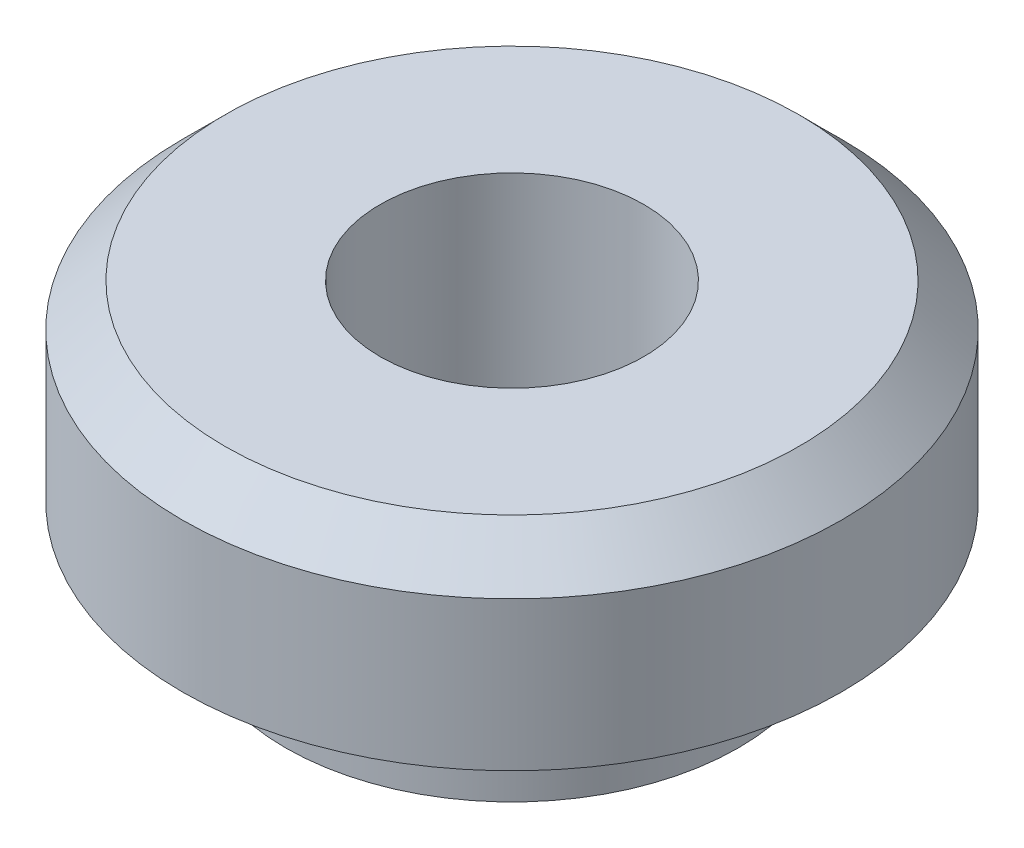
ISO-10303-21;
HEADER;
FILE_DESCRIPTION(('STEP AP214'),'2;1');
FILE_NAME('part.step','',(''),(''),'','','');
FILE_SCHEMA(('AUTOMOTIVE_DESIGN { 1 0 10303 214 1 1 1 1 }'));
ENDSEC;
DATA;
#1=APPLICATION_CONTEXT('core data for automotive mechanical design processes');
#2=APPLICATION_PROTOCOL_DEFINITION('international standard','automotive_design',2000,#1);
#3=PRODUCT_CONTEXT('',#1,'mechanical');
#4=PRODUCT('Part','Part','',(#3));
#5=PRODUCT_RELATED_PRODUCT_CATEGORY('part','',(#4));
#6=PRODUCT_DEFINITION_FORMATION('','',#4);
#7=PRODUCT_DEFINITION_CONTEXT('part definition',#1,'design');
#8=PRODUCT_DEFINITION('design','',#6,#7);
#9=PRODUCT_DEFINITION_SHAPE('','',#8);
#10=(LENGTH_UNIT() NAMED_UNIT(*) SI_UNIT(.MILLI.,.METRE.));
#11=(NAMED_UNIT(*) PLANE_ANGLE_UNIT() SI_UNIT($,.RADIAN.));
#12=(NAMED_UNIT(*) SI_UNIT($,.STERADIAN.) SOLID_ANGLE_UNIT());
#13=UNCERTAINTY_MEASURE_WITH_UNIT(LENGTH_MEASURE(1.E-05),#10,'distance_accuracy_value','');
#14=(GEOMETRIC_REPRESENTATION_CONTEXT(3) GLOBAL_UNCERTAINTY_ASSIGNED_CONTEXT((#13)) GLOBAL_UNIT_ASSIGNED_CONTEXT((#10,
#11,#12)) REPRESENTATION_CONTEXT('',''));
#15=CARTESIAN_POINT('',(0.,0.,0.));
#16=DIRECTION('',(0.,0.,1.));
#17=DIRECTION('',(1.,0.,0.));
#18=AXIS2_PLACEMENT_3D('',#15,#16,#17);
#19=CARTESIAN_POINT('',(0.,-1.1938,2.7051));
#20=DIRECTION('',(0.,-1.,0.));
#21=DIRECTION('',(0.,0.,-1.));
#22=AXIS2_PLACEMENT_3D('',#19,#20,#21);
#23=PLANE('',#22);
#24=CARTESIAN_POINT('',(0.,-1.1938,0.));
#25=DIRECTION('',(0.,1.,0.));
#26=DIRECTION('',(0.,0.,1.));
#27=AXIS2_PLACEMENT_3D('',#24,#25,#26);
#28=CIRCLE('',#27,1.5748);
#29=CARTESIAN_POINT('',(0.,-1.1938,1.5748));
#30=VERTEX_POINT('',#29);
#31=EDGE_CURVE('E10',#30,#30,#28,.T.);
#32=ORIENTED_EDGE('',*,*,#31,.T.);
#33=EDGE_LOOP('',(#32));
#34=FACE_BOUND('',#33,.T.);
#35=CARTESIAN_POINT('',(0.,-1.1938,0.));
#36=DIRECTION('',(0.,1.,0.));
#37=DIRECTION('',(0.,0.,1.));
#38=AXIS2_PLACEMENT_3D('',#35,#36,#37);
#39=CIRCLE('',#38,2.7051);
#40=CARTESIAN_POINT('',(0.,-1.1938,2.7051));
#41=VERTEX_POINT('',#40);
#42=EDGE_CURVE('E59',#41,#41,#39,.T.);
#43=ORIENTED_EDGE('',*,*,#42,.F.);
#44=EDGE_LOOP('',(#43));
#45=FACE_BOUND('',#44,.T.);
#46=ADVANCED_FACE('F34',(#34,#45),#23,.T.);
#47=CARTESIAN_POINT('',(0.,2.54,0.));
#48=DIRECTION('',(0.,1.,0.));
#49=DIRECTION('',(0.,0.,1.));
#50=AXIS2_PLACEMENT_3D('',#47,#48,#49);
#51=CYLINDRICAL_SURFACE('',#50,1.5748);
#52=CARTESIAN_POINT('',(0.,2.286,0.));
#53=DIRECTION('',(0.,1.,0.));
#54=DIRECTION('',(0.,0.,1.));
#55=AXIS2_PLACEMENT_3D('',#52,#53,#54);
#56=CIRCLE('',#55,1.5748);
#57=CARTESIAN_POINT('',(0.,2.286,1.5748));
#58=VERTEX_POINT('',#57);
#59=EDGE_CURVE('E40',#58,#58,#56,.T.);
#60=ORIENTED_EDGE('',*,*,#59,.T.);
#61=EDGE_LOOP('',(#60));
#62=FACE_BOUND('',#61,.T.);
#63=ORIENTED_EDGE('',*,*,#31,.F.);
#64=EDGE_LOOP('',(#63));
#65=FACE_BOUND('',#64,.T.);
#66=ADVANCED_FACE('F67',(#62,#65),#51,.F.);
#67=CARTESIAN_POINT('',(0.,2.286,1.5748));
#68=DIRECTION('',(0.,1.,0.));
#69=DIRECTION('',(0.,0.,1.));
#70=AXIS2_PLACEMENT_3D('',#67,#68,#69);
#71=PLANE('',#70);
#72=CARTESIAN_POINT('',(0.,2.286,0.));
#73=DIRECTION('',(0.,1.,0.));
#74=DIRECTION('',(0.,0.,1.));
#75=AXIS2_PLACEMENT_3D('',#72,#73,#74);
#76=CIRCLE('',#75,3.429);
#77=CARTESIAN_POINT('',(0.,2.286,3.429));
#78=VERTEX_POINT('',#77);
#79=EDGE_CURVE('E44',#78,#78,#76,.T.);
#80=ORIENTED_EDGE('',*,*,#79,.T.);
#81=EDGE_LOOP('',(#80));
#82=FACE_BOUND('',#81,.T.);
#83=ORIENTED_EDGE('',*,*,#59,.F.);
#84=EDGE_LOOP('',(#83));
#85=FACE_BOUND('',#84,.T.);
#86=ADVANCED_FACE('F71',(#82,#85),#71,.T.);
#87=CARTESIAN_POINT('',(0.,2.286,0.));
#88=DIRECTION('',(0.,-1.,0.));
#89=DIRECTION('',(0.,0.,-1.));
#90=AXIS2_PLACEMENT_3D('',#87,#88,#89);
#91=CONICAL_SURFACE('',#90,3.429,0.785398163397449);
#92=CARTESIAN_POINT('',(0.,1.778,0.));
#93=DIRECTION('',(0.,1.,0.));
#94=DIRECTION('',(0.,0.,1.));
#95=AXIS2_PLACEMENT_3D('',#92,#93,#94);
#96=CIRCLE('',#95,3.937);
#97=CARTESIAN_POINT('',(0.,1.778,3.937));
#98=VERTEX_POINT('',#97);
#99=EDGE_CURVE('E48',#98,#98,#96,.T.);
#100=ORIENTED_EDGE('',*,*,#99,.T.);
#101=EDGE_LOOP('',(#100));
#102=FACE_BOUND('',#101,.T.);
#103=ORIENTED_EDGE('',*,*,#79,.F.);
#104=EDGE_LOOP('',(#103));
#105=FACE_BOUND('',#104,.T.);
#106=ADVANCED_FACE('F75',(#102,#105),#91,.T.);
#107=CARTESIAN_POINT('',(0.,2.54,0.));
#108=DIRECTION('',(0.,1.,0.));
#109=DIRECTION('',(0.,0.,1.));
#110=AXIS2_PLACEMENT_3D('',#107,#108,#109);
#111=CYLINDRICAL_SURFACE('',#110,3.937);
#112=CARTESIAN_POINT('',(0.,0.,0.));
#113=DIRECTION('',(0.,1.,0.));
#114=DIRECTION('',(0.,0.,1.));
#115=AXIS2_PLACEMENT_3D('',#112,#113,#114);
#116=CIRCLE('',#115,3.937);
#117=CARTESIAN_POINT('',(0.,0.,3.937));
#118=VERTEX_POINT('',#117);
#119=EDGE_CURVE('E53',#118,#118,#116,.T.);
#120=ORIENTED_EDGE('',*,*,#119,.T.);
#121=EDGE_LOOP('',(#120));
#122=FACE_BOUND('',#121,.T.);
#123=ORIENTED_EDGE('',*,*,#99,.F.);
#124=EDGE_LOOP('',(#123));
#125=FACE_BOUND('',#124,.T.);
#126=ADVANCED_FACE('F82',(#122,#125),#111,.T.);
#127=CARTESIAN_POINT('',(0.,0.,3.937));
#128=DIRECTION('',(0.,-1.,0.));
#129=DIRECTION('',(0.,0.,-1.));
#130=AXIS2_PLACEMENT_3D('',#127,#128,#129);
#131=PLANE('',#130);
#132=CARTESIAN_POINT('',(0.,0.,0.));
#133=DIRECTION('',(0.,1.,0.));
#134=DIRECTION('',(0.,0.,1.));
#135=AXIS2_PLACEMENT_3D('',#132,#133,#134);
#136=CIRCLE('',#135,2.7051);
#137=CARTESIAN_POINT('',(0.,0.,2.7051));
#138=VERTEX_POINT('',#137);
#139=EDGE_CURVE('E56',#138,#138,#136,.T.);
#140=ORIENTED_EDGE('',*,*,#139,.T.);
#141=EDGE_LOOP('',(#140));
#142=FACE_BOUND('',#141,.T.);
#143=ORIENTED_EDGE('',*,*,#119,.F.);
#144=EDGE_LOOP('',(#143));
#145=FACE_BOUND('',#144,.T.);
#146=ADVANCED_FACE('F86',(#142,#145),#131,.T.);
#147=CARTESIAN_POINT('',(0.,2.54,0.));
#148=DIRECTION('',(0.,1.,0.));
#149=DIRECTION('',(0.,0.,1.));
#150=AXIS2_PLACEMENT_3D('',#147,#148,#149);
#151=CYLINDRICAL_SURFACE('',#150,2.7051);
#152=ORIENTED_EDGE('',*,*,#42,.T.);
#153=EDGE_LOOP('',(#152));
#154=FACE_BOUND('',#153,.T.);
#155=ORIENTED_EDGE('',*,*,#139,.F.);
#156=EDGE_LOOP('',(#155));
#157=FACE_BOUND('',#156,.T.);
#158=ADVANCED_FACE('F63',(#154,#157),#151,.T.);
#159=CLOSED_SHELL('',(#46,#66,#86,#106,#126,#146,#158));
#160=MANIFOLD_SOLID_BREP('B2',#159);
#161=ADVANCED_BREP_SHAPE_REPRESENTATION('',(#18,#160),#14);
#162=SHAPE_DEFINITION_REPRESENTATION(#9,#161);
ENDSEC;
END-ISO-10303-21;
